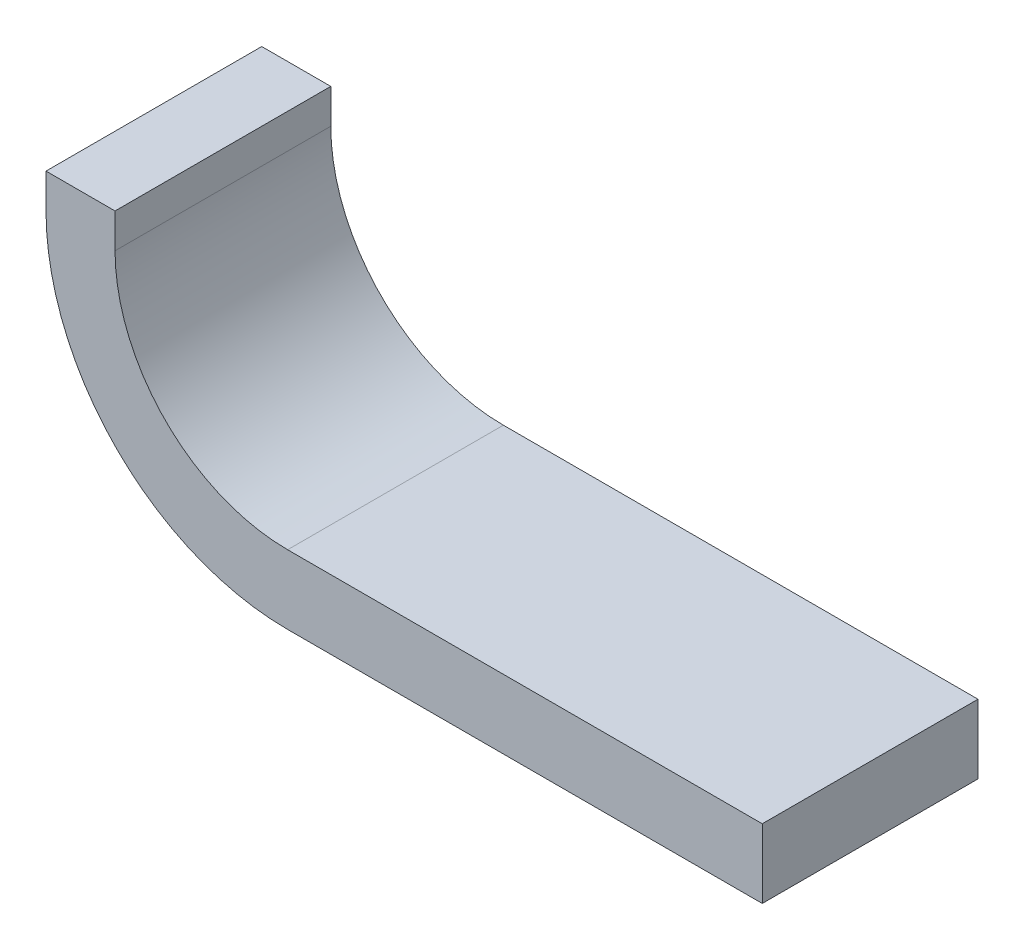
ISO-10303-21;
HEADER;
FILE_DESCRIPTION(('STEP AP214'),'2;1');
FILE_NAME('part.step','',(''),(''),'','','');
FILE_SCHEMA(('AUTOMOTIVE_DESIGN { 1 0 10303 214 1 1 1 1 }'));
ENDSEC;
DATA;
#1=APPLICATION_CONTEXT('core data for automotive mechanical design processes');
#2=APPLICATION_PROTOCOL_DEFINITION('international standard','automotive_design',2000,#1);
#3=PRODUCT_CONTEXT('',#1,'mechanical');
#4=PRODUCT('Part','Part','',(#3));
#5=PRODUCT_RELATED_PRODUCT_CATEGORY('part','',(#4));
#6=PRODUCT_DEFINITION_FORMATION('','',#4);
#7=PRODUCT_DEFINITION_CONTEXT('part definition',#1,'design');
#8=PRODUCT_DEFINITION('design','',#6,#7);
#9=PRODUCT_DEFINITION_SHAPE('','',#8);
#10=(LENGTH_UNIT() NAMED_UNIT(*) SI_UNIT(.MILLI.,.METRE.));
#11=(NAMED_UNIT(*) PLANE_ANGLE_UNIT() SI_UNIT($,.RADIAN.));
#12=(NAMED_UNIT(*) SI_UNIT($,.STERADIAN.) SOLID_ANGLE_UNIT());
#13=UNCERTAINTY_MEASURE_WITH_UNIT(LENGTH_MEASURE(1.E-05),#10,'distance_accuracy_value','');
#14=(GEOMETRIC_REPRESENTATION_CONTEXT(3) GLOBAL_UNCERTAINTY_ASSIGNED_CONTEXT((#13)) GLOBAL_UNIT_ASSIGNED_CONTEXT((#10,
#11,#12)) REPRESENTATION_CONTEXT('',''));
#15=CARTESIAN_POINT('',(0.,0.,0.));
#16=DIRECTION('',(0.,0.,1.));
#17=DIRECTION('',(1.,0.,0.));
#18=AXIS2_PLACEMENT_3D('',#15,#16,#17);
#19=CARTESIAN_POINT('',(0.,8.,25.));
#20=DIRECTION('',(-1.,0.,0.));
#21=DIRECTION('',(0.,-1.,0.));
#22=AXIS2_PLACEMENT_3D('',#19,#20,#21);
#23=PLANE('',#22);
#24=DIRECTION('',(0.,1.,0.));
#25=VECTOR('',#24,1.);
#26=CARTESIAN_POINT('',(0.,8.,0.));
#27=LINE('',#26,#25);
#28=CARTESIAN_POINT('',(0.,0.,0.));
#29=VERTEX_POINT('',#28);
#30=CARTESIAN_POINT('',(0.,8.,0.));
#31=VERTEX_POINT('',#30);
#32=EDGE_CURVE('E99',#29,#31,#27,.T.);
#33=ORIENTED_EDGE('',*,*,#32,.T.);
#34=DIRECTION('',(0.,0.,-1.));
#35=VECTOR('',#34,1.);
#36=CARTESIAN_POINT('',(0.,8.,25.));
#37=LINE('',#36,#35);
#38=CARTESIAN_POINT('',(0.,8.,25.));
#39=VERTEX_POINT('',#38);
#40=EDGE_CURVE('E11',#39,#31,#37,.T.);
#41=ORIENTED_EDGE('',*,*,#40,.F.);
#42=DIRECTION('',(0.,1.,0.));
#43=VECTOR('',#42,1.);
#44=CARTESIAN_POINT('',(0.,8.,25.));
#45=LINE('',#44,#43);
#46=CARTESIAN_POINT('',(0.,0.,25.));
#47=VERTEX_POINT('',#46);
#48=EDGE_CURVE('E126',#47,#39,#45,.T.);
#49=ORIENTED_EDGE('',*,*,#48,.F.);
#50=DIRECTION('',(0.,0.,-1.));
#51=VECTOR('',#50,1.);
#52=CARTESIAN_POINT('',(0.,0.,25.));
#53=LINE('',#52,#51);
#54=EDGE_CURVE('E112',#47,#29,#53,.T.);
#55=ORIENTED_EDGE('',*,*,#54,.T.);
#56=EDGE_LOOP('',(#33,#41,#49,#55));
#57=FACE_BOUND('',#56,.T.);
#58=ADVANCED_FACE('F31',(#57),#23,.F.);
#59=CARTESIAN_POINT('',(-55.,8.,25.));
#60=DIRECTION('',(0.,-1.,0.));
#61=DIRECTION('',(0.,0.,-1.));
#62=AXIS2_PLACEMENT_3D('',#59,#60,#61);
#63=PLANE('',#62);
#64=DIRECTION('',(-1.,0.,0.));
#65=VECTOR('',#64,1.);
#66=CARTESIAN_POINT('',(-55.,8.,0.));
#67=LINE('',#66,#65);
#68=CARTESIAN_POINT('',(-55.,8.00000000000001,0.));
#69=VERTEX_POINT('',#68);
#70=EDGE_CURVE('E95',#31,#69,#67,.T.);
#71=ORIENTED_EDGE('',*,*,#70,.T.);
#72=DIRECTION('',(0.,0.,-1.));
#73=VECTOR('',#72,1.);
#74=CARTESIAN_POINT('',(-55.,8.00000000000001,25.));
#75=LINE('',#74,#73);
#76=CARTESIAN_POINT('',(-55.,8.00000000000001,25.));
#77=VERTEX_POINT('',#76);
#78=EDGE_CURVE('E38',#77,#69,#75,.T.);
#79=ORIENTED_EDGE('',*,*,#78,.F.);
#80=DIRECTION('',(-1.,0.,0.));
#81=VECTOR('',#80,1.);
#82=CARTESIAN_POINT('',(-55.,8.,25.));
#83=LINE('',#82,#81);
#84=EDGE_CURVE('E108',#39,#77,#83,.T.);
#85=ORIENTED_EDGE('',*,*,#84,.F.);
#86=ORIENTED_EDGE('',*,*,#40,.T.);
#87=EDGE_LOOP('',(#71,#79,#85,#86));
#88=FACE_BOUND('',#87,.T.);
#89=ADVANCED_FACE('F107',(#88),#63,.F.);
#90=CARTESIAN_POINT('',(-55.,28.,25.));
#91=DIRECTION('',(0.,0.,-1.));
#92=DIRECTION('',(-1.,0.,0.));
#93=AXIS2_PLACEMENT_3D('',#90,#91,#92);
#94=CYLINDRICAL_SURFACE('',#93,20.);
#95=CARTESIAN_POINT('',(-55.,28.,0.));
#96=DIRECTION('',(0.,0.,-1.));
#97=DIRECTION('',(1.,0.,0.));
#98=AXIS2_PLACEMENT_3D('',#95,#96,#97);
#99=CIRCLE('',#98,20.);
#100=CARTESIAN_POINT('',(-75.,28.,0.));
#101=VERTEX_POINT('',#100);
#102=EDGE_CURVE('E101',#69,#101,#99,.T.);
#103=ORIENTED_EDGE('',*,*,#102,.T.);
#104=DIRECTION('',(0.,0.,-1.));
#105=VECTOR('',#104,1.);
#106=CARTESIAN_POINT('',(-75.,28.,25.));
#107=LINE('',#106,#105);
#108=CARTESIAN_POINT('',(-75.,28.,25.));
#109=VERTEX_POINT('',#108);
#110=EDGE_CURVE('E152',#109,#101,#107,.T.);
#111=ORIENTED_EDGE('',*,*,#110,.F.);
#112=CARTESIAN_POINT('',(-55.,28.,25.));
#113=DIRECTION('',(0.,0.,-1.));
#114=DIRECTION('',(1.,0.,0.));
#115=AXIS2_PLACEMENT_3D('',#112,#113,#114);
#116=CIRCLE('',#115,20.);
#117=EDGE_CURVE('E129',#77,#109,#116,.T.);
#118=ORIENTED_EDGE('',*,*,#117,.F.);
#119=ORIENTED_EDGE('',*,*,#78,.T.);
#120=EDGE_LOOP('',(#103,#111,#118,#119));
#121=FACE_BOUND('',#120,.T.);
#122=ADVANCED_FACE('F156',(#121),#94,.F.);
#123=CARTESIAN_POINT('',(-75.,32.,25.));
#124=DIRECTION('',(-1.,0.,0.));
#125=DIRECTION('',(0.,-1.,0.));
#126=AXIS2_PLACEMENT_3D('',#123,#124,#125);
#127=PLANE('',#126);
#128=DIRECTION('',(0.,1.,0.));
#129=VECTOR('',#128,1.);
#130=CARTESIAN_POINT('',(-75.,32.,0.));
#131=LINE('',#130,#129);
#132=CARTESIAN_POINT('',(-75.,32.,0.));
#133=VERTEX_POINT('',#132);
#134=EDGE_CURVE('E116',#101,#133,#131,.T.);
#135=ORIENTED_EDGE('',*,*,#134,.T.);
#136=DIRECTION('',(0.,0.,-1.));
#137=VECTOR('',#136,1.);
#138=CARTESIAN_POINT('',(-75.,32.,25.));
#139=LINE('',#138,#137);
#140=CARTESIAN_POINT('',(-75.,32.,25.));
#141=VERTEX_POINT('',#140);
#142=EDGE_CURVE('E149',#141,#133,#139,.T.);
#143=ORIENTED_EDGE('',*,*,#142,.F.);
#144=DIRECTION('',(0.,1.,0.));
#145=VECTOR('',#144,1.);
#146=CARTESIAN_POINT('',(-75.,32.,25.));
#147=LINE('',#146,#145);
#148=EDGE_CURVE('E131',#109,#141,#147,.T.);
#149=ORIENTED_EDGE('',*,*,#148,.F.);
#150=ORIENTED_EDGE('',*,*,#110,.T.);
#151=EDGE_LOOP('',(#135,#143,#149,#150));
#152=FACE_BOUND('',#151,.T.);
#153=ADVANCED_FACE('F164',(#152),#127,.F.);
#154=CARTESIAN_POINT('',(-83.,32.,25.));
#155=DIRECTION('',(0.,-1.,0.));
#156=DIRECTION('',(0.,0.,-1.));
#157=AXIS2_PLACEMENT_3D('',#154,#155,#156);
#158=PLANE('',#157);
#159=DIRECTION('',(-1.,0.,0.));
#160=VECTOR('',#159,1.);
#161=CARTESIAN_POINT('',(-83.,32.,0.));
#162=LINE('',#161,#160);
#163=CARTESIAN_POINT('',(-83.,32.,0.));
#164=VERTEX_POINT('',#163);
#165=EDGE_CURVE('E118',#133,#164,#162,.T.);
#166=ORIENTED_EDGE('',*,*,#165,.T.);
#167=DIRECTION('',(0.,0.,-1.));
#168=VECTOR('',#167,1.);
#169=CARTESIAN_POINT('',(-83.,32.,25.));
#170=LINE('',#169,#168);
#171=CARTESIAN_POINT('',(-83.,32.,25.));
#172=VERTEX_POINT('',#171);
#173=EDGE_CURVE('E146',#172,#164,#170,.T.);
#174=ORIENTED_EDGE('',*,*,#173,.F.);
#175=DIRECTION('',(-1.,0.,0.));
#176=VECTOR('',#175,1.);
#177=CARTESIAN_POINT('',(-83.,32.,25.));
#178=LINE('',#177,#176);
#179=EDGE_CURVE('E133',#141,#172,#178,.T.);
#180=ORIENTED_EDGE('',*,*,#179,.F.);
#181=ORIENTED_EDGE('',*,*,#142,.T.);
#182=EDGE_LOOP('',(#166,#174,#180,#181));
#183=FACE_BOUND('',#182,.T.);
#184=ADVANCED_FACE('F167',(#183),#158,.F.);
#185=CARTESIAN_POINT('',(-83.,28.,25.));
#186=DIRECTION('',(1.,0.,0.));
#187=DIRECTION('',(0.,1.,0.));
#188=AXIS2_PLACEMENT_3D('',#185,#186,#187);
#189=PLANE('',#188);
#190=DIRECTION('',(0.,-1.,0.));
#191=VECTOR('',#190,1.);
#192=CARTESIAN_POINT('',(-83.,28.,0.));
#193=LINE('',#192,#191);
#194=CARTESIAN_POINT('',(-83.,28.,0.));
#195=VERTEX_POINT('',#194);
#196=EDGE_CURVE('E120',#164,#195,#193,.T.);
#197=ORIENTED_EDGE('',*,*,#196,.T.);
#198=DIRECTION('',(0.,0.,-1.));
#199=VECTOR('',#198,1.);
#200=CARTESIAN_POINT('',(-83.,28.,25.));
#201=LINE('',#200,#199);
#202=CARTESIAN_POINT('',(-83.,28.,25.));
#203=VERTEX_POINT('',#202);
#204=EDGE_CURVE('E143',#203,#195,#201,.T.);
#205=ORIENTED_EDGE('',*,*,#204,.F.);
#206=DIRECTION('',(0.,-1.,0.));
#207=VECTOR('',#206,1.);
#208=CARTESIAN_POINT('',(-83.,28.,25.));
#209=LINE('',#208,#207);
#210=EDGE_CURVE('E135',#172,#203,#209,.T.);
#211=ORIENTED_EDGE('',*,*,#210,.F.);
#212=ORIENTED_EDGE('',*,*,#173,.T.);
#213=EDGE_LOOP('',(#197,#205,#211,#212));
#214=FACE_BOUND('',#213,.T.);
#215=ADVANCED_FACE('F172',(#214),#189,.F.);
#216=CARTESIAN_POINT('',(-55.,28.,25.));
#217=DIRECTION('',(0.,0.,-1.));
#218=DIRECTION('',(-1.,0.,0.));
#219=AXIS2_PLACEMENT_3D('',#216,#217,#218);
#220=CYLINDRICAL_SURFACE('',#219,28.);
#221=CARTESIAN_POINT('',(-55.,28.,0.));
#222=DIRECTION('',(0.,0.,1.));
#223=DIRECTION('',(-1.,0.,0.));
#224=AXIS2_PLACEMENT_3D('',#221,#222,#223);
#225=CIRCLE('',#224,28.);
#226=CARTESIAN_POINT('',(-55.,0.,0.));
#227=VERTEX_POINT('',#226);
#228=EDGE_CURVE('E122',#195,#227,#225,.T.);
#229=ORIENTED_EDGE('',*,*,#228,.T.);
#230=DIRECTION('',(0.,0.,-1.));
#231=VECTOR('',#230,1.);
#232=CARTESIAN_POINT('',(-55.,0.,25.));
#233=LINE('',#232,#231);
#234=CARTESIAN_POINT('',(-55.,0.,25.));
#235=VERTEX_POINT('',#234);
#236=EDGE_CURVE('E140',#235,#227,#233,.T.);
#237=ORIENTED_EDGE('',*,*,#236,.F.);
#238=CARTESIAN_POINT('',(-55.,28.,25.));
#239=DIRECTION('',(0.,0.,1.));
#240=DIRECTION('',(-1.,0.,0.));
#241=AXIS2_PLACEMENT_3D('',#238,#239,#240);
#242=CIRCLE('',#241,28.);
#243=EDGE_CURVE('E50',#203,#235,#242,.T.);
#244=ORIENTED_EDGE('',*,*,#243,.F.);
#245=ORIENTED_EDGE('',*,*,#204,.T.);
#246=EDGE_LOOP('',(#229,#237,#244,#245));
#247=FACE_BOUND('',#246,.T.);
#248=ADVANCED_FACE('F175',(#247),#220,.T.);
#249=CARTESIAN_POINT('',(0.,0.,25.));
#250=DIRECTION('',(0.,1.,0.));
#251=DIRECTION('',(-1.,0.,0.));
#252=AXIS2_PLACEMENT_3D('',#249,#250,#251);
#253=PLANE('',#252);
#254=DIRECTION('',(1.,0.,0.));
#255=VECTOR('',#254,1.);
#256=CARTESIAN_POINT('',(0.,0.,0.));
#257=LINE('',#256,#255);
#258=EDGE_CURVE('E124',#227,#29,#257,.T.);
#259=ORIENTED_EDGE('',*,*,#258,.T.);
#260=ORIENTED_EDGE('',*,*,#54,.F.);
#261=DIRECTION('',(1.,0.,0.));
#262=VECTOR('',#261,1.);
#263=CARTESIAN_POINT('',(0.,0.,25.));
#264=LINE('',#263,#262);
#265=EDGE_CURVE('E45',#235,#47,#264,.T.);
#266=ORIENTED_EDGE('',*,*,#265,.F.);
#267=ORIENTED_EDGE('',*,*,#236,.T.);
#268=EDGE_LOOP('',(#259,#260,#266,#267));
#269=FACE_BOUND('',#268,.T.);
#270=ADVANCED_FACE('F177',(#269),#253,.F.);
#271=CARTESIAN_POINT('',(-55.,28.,25.));
#272=DIRECTION('',(0.,0.,-1.));
#273=DIRECTION('',(-1.,0.,0.));
#274=AXIS2_PLACEMENT_3D('',#271,#272,#273);
#275=PLANE('',#274);
#276=ORIENTED_EDGE('',*,*,#48,.T.);
#277=ORIENTED_EDGE('',*,*,#84,.T.);
#278=ORIENTED_EDGE('',*,*,#117,.T.);
#279=ORIENTED_EDGE('',*,*,#148,.T.);
#280=ORIENTED_EDGE('',*,*,#179,.T.);
#281=ORIENTED_EDGE('',*,*,#210,.T.);
#282=ORIENTED_EDGE('',*,*,#243,.T.);
#283=ORIENTED_EDGE('',*,*,#265,.T.);
#284=EDGE_LOOP('',(#276,#277,#278,#279,#280,#281,#282,#283));
#285=FACE_BOUND('',#284,.T.);
#286=ADVANCED_FACE('F159',(#285),#275,.F.);
#287=CARTESIAN_POINT('',(-55.,28.,0.));
#288=DIRECTION('',(0.,0.,-1.));
#289=DIRECTION('',(-1.,0.,0.));
#290=AXIS2_PLACEMENT_3D('',#287,#288,#289);
#291=PLANE('',#290);
#292=ORIENTED_EDGE('',*,*,#32,.F.);
#293=ORIENTED_EDGE('',*,*,#258,.F.);
#294=ORIENTED_EDGE('',*,*,#228,.F.);
#295=ORIENTED_EDGE('',*,*,#196,.F.);
#296=ORIENTED_EDGE('',*,*,#165,.F.);
#297=ORIENTED_EDGE('',*,*,#134,.F.);
#298=ORIENTED_EDGE('',*,*,#102,.F.);
#299=ORIENTED_EDGE('',*,*,#70,.F.);
#300=EDGE_LOOP('',(#292,#293,#294,#295,#296,#297,#298,#299));
#301=FACE_BOUND('',#300,.T.);
#302=ADVANCED_FACE('F96',(#301),#291,.T.);
#303=CLOSED_SHELL('',(#58,#89,#122,#153,#184,#215,#248,#270,#286,#302));
#304=MANIFOLD_SOLID_BREP('B2',#303);
#305=ADVANCED_BREP_SHAPE_REPRESENTATION('',(#18,#304),#14);
#306=SHAPE_DEFINITION_REPRESENTATION(#9,#305);
ENDSEC;
END-ISO-10303-21;
